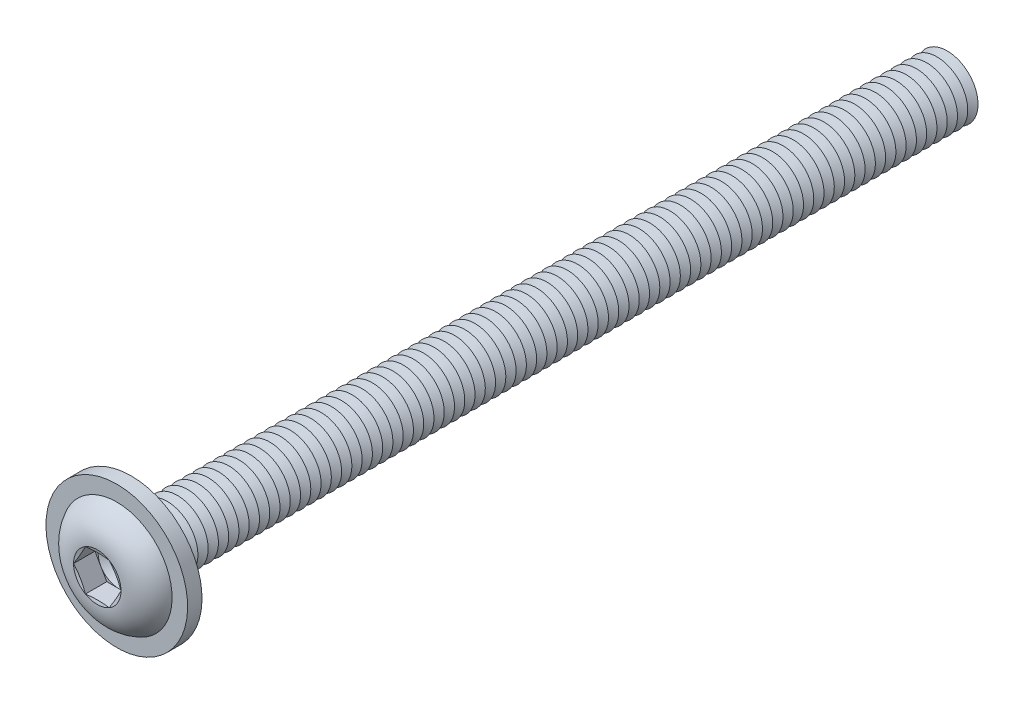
from build123d import *

# Parameters (mm, degrees)
FILLET1_R           = 0.25
LPATTERN1_COUNT     = 80
LPATTERN1_PITCH     = 0.5
CUT_EXTRUDE1_DEPTH  = 1.04
SKETCH5_R           = 3.45
SKETCH5_R_2         = 1.75
BOSS_EXTRUDE1_DEPTH = 0.7


with BuildPart() as part:
    # Sketch1 → Revolve1 (revolve)
    with BuildSketch(Plane(origin=(0, 0, 0), x_dir=(0, 0, -1), z_dir=(1, 0, 0))):
        with BuildLine():
            Line((0, 1.5), (0, 2.85))
            ThreePointArc((0, 2.85), (-1.182850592, 2.35063849), (-1.65, 1.1547))
            Line((-1.65, 1.1547), (-1.495299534, 0.57735))
            Line((-1.495299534, 0.57735), (-1.65, 0.57735))
            Line((-1.65, 0.57735), (-1.65, 0))
            Line((-1.65, 0), (40, 0))
            Line((40, 0), (40, 1.5))
            Line((40, 1.5), (0, 1.5))
        make_face()
    revolve(axis=Axis((0, 0, -40), (0, 0, 1)))

    # Fillet1
    fillet1_edges = [part.edges().sort_by_distance(p)[0] for p in [
        (0, -1.5, 0),
    ]]
    fillet(fillet1_edges, radius=FILLET1_R)

    # Sketch2 → Cut-Revolve1 (revolve, cut)
    with BuildSketch(Plane(origin=(0, 0, 0), x_dir=(0, 0, -1), z_dir=(1, 0, 0))):
        Polygon((39.75, 1.5), (40.25, 1.5), (40, 1.066987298), align=None)
    cut_revolve1 = revolve(axis=Axis((0, 0, -40), (0, 0, -1)), mode=Mode.SUBTRACT)

    # LPattern1: Cut-Revolve1 ×80
    with Locations(*[(0, 0, i * LPATTERN1_PITCH) for i in range(1, LPATTERN1_COUNT)]):
        add(cut_revolve1, mode=Mode.SUBTRACT)

    # Sketch3 → Cut-Extrude1 (cut)
    with BuildSketch(Plane.XY.offset(1.65)):
        Polygon((0.57735, 0.999999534), (-0.57735, 0.999999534), (-1.1547, 0), (-0.57735, -0.999999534), (0.57735, -0.999999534), (1.1547, 0), align=None)
    extrude(amount=-CUT_EXTRUDE1_DEPTH, mode=Mode.SUBTRACT)

    # Cut-Extrude2 cone 1 section (on through the dimple's axis) → Cut-Extrude2 (revolve, cut)
    with BuildSketch(Plane(origin=(0, 0, 0.61), x_dir=(0, -1, 0), z_dir=(1, 0, 0))):
        Polygon((0, 0), (0.999999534, 0), (0, 0.57735), align=None)
    revolve(axis=Axis((0, 0, 0.61), (0, 0, -1)), mode=Mode.SUBTRACT)

    # Sketch5 → Boss-Extrude1 (add)
    with BuildSketch(Plane(origin=(0, 0, 0), x_dir=(-1, 0, 0), z_dir=(0, 0, -1))):
        with Locations(Location((0, 0, 0), (0, 0, 90))):
            Circle(SKETCH5_R)
        Circle(SKETCH5_R_2, mode=Mode.SUBTRACT)
    extrude(amount=-BOSS_EXTRUDE1_DEPTH)


solid = part.part
